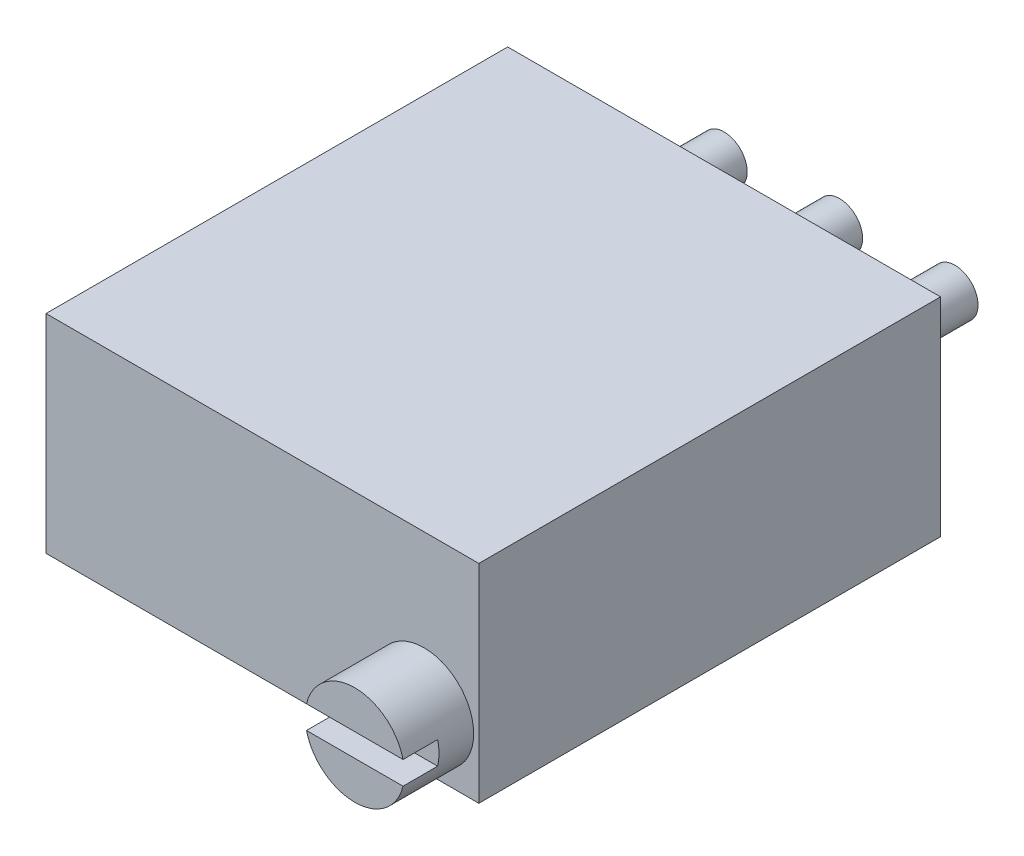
ISO-10303-21;
HEADER;
FILE_DESCRIPTION(('STEP AP214'),'2;1');
FILE_NAME('part.step','',(''),(''),'','','');
FILE_SCHEMA(('AUTOMOTIVE_DESIGN { 1 0 10303 214 1 1 1 1 }'));
ENDSEC;
DATA;
#1=APPLICATION_CONTEXT('core data for automotive mechanical design processes');
#2=APPLICATION_PROTOCOL_DEFINITION('international standard','automotive_design',2000,#1);
#3=PRODUCT_CONTEXT('',#1,'mechanical');
#4=PRODUCT('Part','Part','',(#3));
#5=PRODUCT_RELATED_PRODUCT_CATEGORY('part','',(#4));
#6=PRODUCT_DEFINITION_FORMATION('','',#4);
#7=PRODUCT_DEFINITION_CONTEXT('part definition',#1,'design');
#8=PRODUCT_DEFINITION('design','',#6,#7);
#9=PRODUCT_DEFINITION_SHAPE('','',#8);
#10=(LENGTH_UNIT() NAMED_UNIT(*) SI_UNIT(.MILLI.,.METRE.));
#11=(NAMED_UNIT(*) PLANE_ANGLE_UNIT() SI_UNIT($,.RADIAN.));
#12=(NAMED_UNIT(*) SI_UNIT($,.STERADIAN.) SOLID_ANGLE_UNIT());
#13=UNCERTAINTY_MEASURE_WITH_UNIT(LENGTH_MEASURE(1.E-05),#10,'distance_accuracy_value','');
#14=(GEOMETRIC_REPRESENTATION_CONTEXT(3) GLOBAL_UNCERTAINTY_ASSIGNED_CONTEXT((#13)) GLOBAL_UNIT_ASSIGNED_CONTEXT((#10,
#11,#12)) REPRESENTATION_CONTEXT('',''));
#15=CARTESIAN_POINT('',(0.,0.,0.));
#16=DIRECTION('',(0.,0.,1.));
#17=DIRECTION('',(1.,0.,0.));
#18=AXIS2_PLACEMENT_3D('',#15,#16,#17);
#19=CARTESIAN_POINT('',(3.556,-1.016,11.684));
#20=DIRECTION('',(0.,0.,1.));
#21=DIRECTION('',(1.,0.,0.));
#22=AXIS2_PLACEMENT_3D('',#19,#20,#21);
#23=PLANE('',#22);
#24=DIRECTION('',(-1.,0.,0.));
#25=VECTOR('',#24,1.);
#26=CARTESIAN_POINT('',(3.556,-0.762,11.684));
#27=LINE('',#26,#25);
#28=CARTESIAN_POINT('',(4.61825460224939,-0.762,11.684));
#29=VERTEX_POINT('',#28);
#30=CARTESIAN_POINT('',(2.49374539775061,-0.762,11.684));
#31=VERTEX_POINT('',#30);
#32=EDGE_CURVE('E85',#29,#31,#27,.T.);
#33=ORIENTED_EDGE('',*,*,#32,.F.);
#34=CARTESIAN_POINT('',(3.556,-1.016,11.684));
#35=DIRECTION('',(0.,0.,1.));
#36=DIRECTION('',(1.,0.,0.));
#37=AXIS2_PLACEMENT_3D('',#34,#35,#36);
#38=CIRCLE('',#37,1.0922);
#39=EDGE_CURVE('E86',#29,#31,#38,.T.);
#40=ORIENTED_EDGE('',*,*,#39,.T.);
#41=EDGE_LOOP('',(#33,#40));
#42=FACE_BOUND('',#41,.T.);
#43=ADVANCED_FACE('F40',(#42),#23,.T.);
#44=CARTESIAN_POINT('',(3.556,-1.016,11.684));
#45=DIRECTION('',(0.,0.,-1.));
#46=DIRECTION('',(-1.,0.,0.));
#47=AXIS2_PLACEMENT_3D('',#44,#45,#46);
#48=CYLINDRICAL_SURFACE('',#47,1.0922);
#49=CARTESIAN_POINT('',(3.556,-1.016,10.922));
#50=DIRECTION('',(0.,0.,1.));
#51=DIRECTION('',(1.,0.,0.));
#52=AXIS2_PLACEMENT_3D('',#49,#50,#51);
#53=CIRCLE('',#52,1.0922);
#54=CARTESIAN_POINT('',(2.49374539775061,-0.762,10.922));
#55=VERTEX_POINT('',#54);
#56=CARTESIAN_POINT('',(2.49374539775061,-1.27,10.922));
#57=VERTEX_POINT('',#56);
#58=EDGE_CURVE('E12',#55,#57,#53,.T.);
#59=ORIENTED_EDGE('',*,*,#58,.F.);
#60=DIRECTION('',(0.,0.,-1.));
#61=VECTOR('',#60,1.);
#62=CARTESIAN_POINT('',(2.49374539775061,-0.762,11.684));
#63=LINE('',#62,#61);
#64=EDGE_CURVE('E111',#55,#31,#63,.F.);
#65=ORIENTED_EDGE('',*,*,#64,.T.);
#66=ORIENTED_EDGE('',*,*,#39,.F.);
#67=DIRECTION('',(0.,0.,-1.));
#68=VECTOR('',#67,1.);
#69=CARTESIAN_POINT('',(4.61825460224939,-0.762,11.684));
#70=LINE('',#69,#68);
#71=CARTESIAN_POINT('',(4.61825460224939,-0.762,10.922));
#72=VERTEX_POINT('',#71);
#73=EDGE_CURVE('E99',#29,#72,#70,.T.);
#74=ORIENTED_EDGE('',*,*,#73,.T.);
#75=CARTESIAN_POINT('',(4.61825460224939,-1.27,10.922));
#76=VERTEX_POINT('',#75);
#77=EDGE_CURVE('E44',#76,#72,#53,.T.);
#78=ORIENTED_EDGE('',*,*,#77,.F.);
#79=DIRECTION('',(0.,0.,-1.));
#80=VECTOR('',#79,1.);
#81=CARTESIAN_POINT('',(4.61825460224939,-1.27,11.684));
#82=LINE('',#81,#80);
#83=CARTESIAN_POINT('',(4.61825460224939,-1.27,11.684));
#84=VERTEX_POINT('',#83);
#85=EDGE_CURVE('E80',#76,#84,#82,.F.);
#86=ORIENTED_EDGE('',*,*,#85,.T.);
#87=CARTESIAN_POINT('',(2.49374539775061,-1.27,11.684));
#88=VERTEX_POINT('',#87);
#89=EDGE_CURVE('E90',#88,#84,#38,.T.);
#90=ORIENTED_EDGE('',*,*,#89,.F.);
#91=DIRECTION('',(0.,0.,-1.));
#92=VECTOR('',#91,1.);
#93=CARTESIAN_POINT('',(2.49374539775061,-1.27,11.684));
#94=LINE('',#93,#92);
#95=EDGE_CURVE('E55',#88,#57,#94,.T.);
#96=ORIENTED_EDGE('',*,*,#95,.T.);
#97=EDGE_LOOP('',(#59,#65,#66,#74,#78,#86,#90,#96));
#98=FACE_BOUND('',#97,.T.);
#99=CARTESIAN_POINT('',(3.556,-1.016,10.16));
#100=DIRECTION('',(0.,0.,1.));
#101=DIRECTION('',(1.,0.,0.));
#102=AXIS2_PLACEMENT_3D('',#99,#100,#101);
#103=CIRCLE('',#102,1.0922);
#104=CARTESIAN_POINT('',(4.6482,-1.016,10.16));
#105=VERTEX_POINT('',#104);
#106=EDGE_CURVE('E95',#105,#105,#103,.T.);
#107=ORIENTED_EDGE('',*,*,#106,.T.);
#108=EDGE_LOOP('',(#107));
#109=FACE_BOUND('',#108,.T.);
#110=ADVANCED_FACE('F42',(#98,#109),#48,.T.);
#111=DIRECTION('',(1.,0.,0.));
#112=VECTOR('',#111,1.);
#113=CARTESIAN_POINT('',(3.556,-1.27,11.684));
#114=LINE('',#113,#112);
#115=EDGE_CURVE('E77',#88,#84,#114,.T.);
#116=ORIENTED_EDGE('',*,*,#115,.F.);
#117=ORIENTED_EDGE('',*,*,#89,.T.);
#118=EDGE_LOOP('',(#116,#117));
#119=FACE_BOUND('',#118,.T.);
#120=ADVANCED_FACE('F94',(#119),#23,.T.);
#121=CARTESIAN_POINT('',(3.556,-1.016,10.16));
#122=DIRECTION('',(0.,0.,1.));
#123=DIRECTION('',(1.,0.,0.));
#124=AXIS2_PLACEMENT_3D('',#121,#122,#123);
#125=PLANE('',#124);
#126=ORIENTED_EDGE('',*,*,#106,.F.);
#127=EDGE_LOOP('',(#126));
#128=FACE_BOUND('',#127,.T.);
#129=ADVANCED_FACE('F124',(#128),#125,.F.);
#130=CARTESIAN_POINT('',(2.4638,-1.27,10.922));
#131=DIRECTION('',(0.,0.,1.));
#132=DIRECTION('',(1.,0.,0.));
#133=AXIS2_PLACEMENT_3D('',#130,#131,#132);
#134=PLANE('',#133);
#135=DIRECTION('',(-1.,0.,0.));
#136=VECTOR('',#135,1.);
#137=CARTESIAN_POINT('',(2.4638,-0.762,10.922));
#138=LINE('',#137,#136);
#139=EDGE_CURVE('E92',#72,#55,#138,.T.);
#140=ORIENTED_EDGE('',*,*,#139,.T.);
#141=ORIENTED_EDGE('',*,*,#58,.T.);
#142=DIRECTION('',(1.,0.,0.));
#143=VECTOR('',#142,1.);
#144=CARTESIAN_POINT('',(2.4638,-1.27,10.922));
#145=LINE('',#144,#143);
#146=EDGE_CURVE('E109',#57,#76,#145,.T.);
#147=ORIENTED_EDGE('',*,*,#146,.T.);
#148=ORIENTED_EDGE('',*,*,#77,.T.);
#149=EDGE_LOOP('',(#140,#141,#147,#148));
#150=FACE_BOUND('',#149,.T.);
#151=ADVANCED_FACE('F108',(#150),#134,.T.);
#152=CARTESIAN_POINT('',(2.4638,-0.762,10.922));
#153=DIRECTION('',(0.,1.,0.));
#154=DIRECTION('',(0.,0.,1.));
#155=AXIS2_PLACEMENT_3D('',#152,#153,#154);
#156=PLANE('',#155);
#157=ORIENTED_EDGE('',*,*,#32,.T.);
#158=ORIENTED_EDGE('',*,*,#64,.F.);
#159=ORIENTED_EDGE('',*,*,#139,.F.);
#160=ORIENTED_EDGE('',*,*,#73,.F.);
#161=EDGE_LOOP('',(#157,#158,#159,#160));
#162=FACE_BOUND('',#161,.T.);
#163=ADVANCED_FACE('F110',(#162),#156,.F.);
#164=CARTESIAN_POINT('',(2.4638,-1.27,10.922));
#165=DIRECTION('',(0.,-1.,0.));
#166=DIRECTION('',(0.,0.,-1.));
#167=AXIS2_PLACEMENT_3D('',#164,#165,#166);
#168=PLANE('',#167);
#169=ORIENTED_EDGE('',*,*,#115,.T.);
#170=ORIENTED_EDGE('',*,*,#85,.F.);
#171=ORIENTED_EDGE('',*,*,#146,.F.);
#172=ORIENTED_EDGE('',*,*,#95,.F.);
#173=EDGE_LOOP('',(#169,#170,#171,#172));
#174=FACE_BOUND('',#173,.T.);
#175=ADVANCED_FACE('F79',(#174),#168,.F.);
#176=CLOSED_SHELL('',(#43,#110,#120,#129,#151,#163,#175));
#177=MANIFOLD_SOLID_BREP('B2',#176);
#178=CARTESIAN_POINT('',(0.,0.,-2.54));
#179=DIRECTION('',(0.,0.,1.));
#180=DIRECTION('',(1.,0.,0.));
#181=AXIS2_PLACEMENT_3D('',#178,#179,#180);
#182=CYLINDRICAL_SURFACE('',#181,0.508);
#183=CARTESIAN_POINT('',(0.,0.,-2.54));
#184=DIRECTION('',(0.,0.,-1.));
#185=DIRECTION('',(-1.,0.,0.));
#186=AXIS2_PLACEMENT_3D('',#183,#184,#185);
#187=CIRCLE('',#186,0.508);
#188=CARTESIAN_POINT('',(-0.508,0.,-2.54));
#189=VERTEX_POINT('',#188);
#190=EDGE_CURVE('E39',#189,#189,#187,.T.);
#191=ORIENTED_EDGE('',*,*,#190,.F.);
#192=EDGE_LOOP('',(#191));
#193=FACE_BOUND('',#192,.T.);
#194=CARTESIAN_POINT('',(0.,0.,0.));
#195=DIRECTION('',(0.,0.,-1.));
#196=DIRECTION('',(-1.,0.,0.));
#197=AXIS2_PLACEMENT_3D('',#194,#195,#196);
#198=CIRCLE('',#197,0.508);
#199=CARTESIAN_POINT('',(-0.508,0.,0.));
#200=VERTEX_POINT('',#199);
#201=EDGE_CURVE('E187',#200,#200,#198,.T.);
#202=ORIENTED_EDGE('',*,*,#201,.T.);
#203=EDGE_LOOP('',(#202));
#204=FACE_BOUND('',#203,.T.);
#205=ADVANCED_FACE('F184',(#193,#204),#182,.T.);
#206=CARTESIAN_POINT('',(0.,0.,-2.54));
#207=DIRECTION('',(0.,0.,-1.));
#208=DIRECTION('',(-1.,0.,0.));
#209=AXIS2_PLACEMENT_3D('',#206,#207,#208);
#210=PLANE('',#209);
#211=ORIENTED_EDGE('',*,*,#190,.T.);
#212=EDGE_LOOP('',(#211));
#213=FACE_BOUND('',#212,.T.);
#214=ADVANCED_FACE('F199',(#213),#210,.T.);
#215=CARTESIAN_POINT('',(0.,0.,0.));
#216=DIRECTION('',(0.,0.,-1.));
#217=DIRECTION('',(-1.,0.,0.));
#218=AXIS2_PLACEMENT_3D('',#215,#216,#217);
#219=PLANE('',#218);
#220=ORIENTED_EDGE('',*,*,#201,.F.);
#221=EDGE_LOOP('',(#220));
#222=FACE_BOUND('',#221,.T.);
#223=ADVANCED_FACE('F197',(#222),#219,.F.);
#224=CLOSED_SHELL('',(#205,#214,#223));
#225=MANIFOLD_SOLID_BREP('B6',#224);
#226=CARTESIAN_POINT('',(2.54,0.,-2.54));
#227=DIRECTION('',(0.,0.,1.));
#228=DIRECTION('',(1.,0.,0.));
#229=AXIS2_PLACEMENT_3D('',#226,#227,#228);
#230=CYLINDRICAL_SURFACE('',#229,0.508);
#231=CARTESIAN_POINT('',(2.54,0.,-2.54));
#232=DIRECTION('',(0.,0.,-1.));
#233=DIRECTION('',(-1.,0.,0.));
#234=AXIS2_PLACEMENT_3D('',#231,#232,#233);
#235=CIRCLE('',#234,0.508);
#236=CARTESIAN_POINT('',(2.032,0.,-2.54));
#237=VERTEX_POINT('',#236);
#238=EDGE_CURVE('E183',#237,#237,#235,.T.);
#239=ORIENTED_EDGE('',*,*,#238,.F.);
#240=EDGE_LOOP('',(#239));
#241=FACE_BOUND('',#240,.T.);
#242=CARTESIAN_POINT('',(2.54,0.,0.));
#243=DIRECTION('',(0.,0.,-1.));
#244=DIRECTION('',(-1.,0.,0.));
#245=AXIS2_PLACEMENT_3D('',#242,#243,#244);
#246=CIRCLE('',#245,0.508);
#247=CARTESIAN_POINT('',(2.032,0.,0.));
#248=VERTEX_POINT('',#247);
#249=EDGE_CURVE('E236',#248,#248,#246,.T.);
#250=ORIENTED_EDGE('',*,*,#249,.T.);
#251=EDGE_LOOP('',(#250));
#252=FACE_BOUND('',#251,.T.);
#253=ADVANCED_FACE('F233',(#241,#252),#230,.T.);
#254=CARTESIAN_POINT('',(2.54,0.,-2.54));
#255=DIRECTION('',(0.,0.,-1.));
#256=DIRECTION('',(-1.,0.,0.));
#257=AXIS2_PLACEMENT_3D('',#254,#255,#256);
#258=PLANE('',#257);
#259=ORIENTED_EDGE('',*,*,#238,.T.);
#260=EDGE_LOOP('',(#259));
#261=FACE_BOUND('',#260,.T.);
#262=ADVANCED_FACE('F248',(#261),#258,.T.);
#263=CARTESIAN_POINT('',(2.54,0.,0.));
#264=DIRECTION('',(0.,0.,-1.));
#265=DIRECTION('',(-1.,0.,0.));
#266=AXIS2_PLACEMENT_3D('',#263,#264,#265);
#267=PLANE('',#266);
#268=ORIENTED_EDGE('',*,*,#249,.F.);
#269=EDGE_LOOP('',(#268));
#270=FACE_BOUND('',#269,.T.);
#271=ADVANCED_FACE('F246',(#270),#267,.F.);
#272=CLOSED_SHELL('',(#253,#262,#271));
#273=MANIFOLD_SOLID_BREP('B34',#272);
#274=CARTESIAN_POINT('',(-2.54,0.,-2.54));
#275=DIRECTION('',(0.,0.,1.));
#276=DIRECTION('',(1.,0.,0.));
#277=AXIS2_PLACEMENT_3D('',#274,#275,#276);
#278=CYLINDRICAL_SURFACE('',#277,0.508);
#279=CARTESIAN_POINT('',(-2.54,0.,-2.54));
#280=DIRECTION('',(0.,0.,-1.));
#281=DIRECTION('',(-1.,0.,0.));
#282=AXIS2_PLACEMENT_3D('',#279,#280,#281);
#283=CIRCLE('',#282,0.508);
#284=CARTESIAN_POINT('',(-3.048,0.,-2.54));
#285=VERTEX_POINT('',#284);
#286=EDGE_CURVE('E232',#285,#285,#283,.T.);
#287=ORIENTED_EDGE('',*,*,#286,.F.);
#288=EDGE_LOOP('',(#287));
#289=FACE_BOUND('',#288,.T.);
#290=CARTESIAN_POINT('',(-2.54,0.,0.));
#291=DIRECTION('',(0.,0.,-1.));
#292=DIRECTION('',(-1.,0.,0.));
#293=AXIS2_PLACEMENT_3D('',#290,#291,#292);
#294=CIRCLE('',#293,0.508);
#295=CARTESIAN_POINT('',(-3.048,0.,0.));
#296=VERTEX_POINT('',#295);
#297=EDGE_CURVE('E286',#296,#296,#294,.T.);
#298=ORIENTED_EDGE('',*,*,#297,.T.);
#299=EDGE_LOOP('',(#298));
#300=FACE_BOUND('',#299,.T.);
#301=ADVANCED_FACE('F283',(#289,#300),#278,.T.);
#302=CARTESIAN_POINT('',(-2.54,0.,-2.54));
#303=DIRECTION('',(0.,0.,-1.));
#304=DIRECTION('',(-1.,0.,0.));
#305=AXIS2_PLACEMENT_3D('',#302,#303,#304);
#306=PLANE('',#305);
#307=ORIENTED_EDGE('',*,*,#286,.T.);
#308=EDGE_LOOP('',(#307));
#309=FACE_BOUND('',#308,.T.);
#310=ADVANCED_FACE('F298',(#309),#306,.T.);
#311=CARTESIAN_POINT('',(-2.54,0.,0.));
#312=DIRECTION('',(0.,0.,-1.));
#313=DIRECTION('',(-1.,0.,0.));
#314=AXIS2_PLACEMENT_3D('',#311,#312,#313);
#315=PLANE('',#314);
#316=ORIENTED_EDGE('',*,*,#297,.F.);
#317=EDGE_LOOP('',(#316));
#318=FACE_BOUND('',#317,.T.);
#319=ADVANCED_FACE('F296',(#318),#315,.F.);
#320=CLOSED_SHELL('',(#301,#310,#319));
#321=MANIFOLD_SOLID_BREP('B178',#320);
#322=CARTESIAN_POINT('',(-4.7625,2.286,10.16));
#323=DIRECTION('',(1.,0.,0.));
#324=DIRECTION('',(0.,0.,-1.));
#325=AXIS2_PLACEMENT_3D('',#322,#323,#324);
#326=PLANE('',#325);
#327=DIRECTION('',(0.,-1.,0.));
#328=VECTOR('',#327,1.);
#329=CARTESIAN_POINT('',(-4.7625,2.286,0.));
#330=LINE('',#329,#328);
#331=CARTESIAN_POINT('',(-4.7625,2.286,0.));
#332=VERTEX_POINT('',#331);
#333=CARTESIAN_POINT('',(-4.7625,-2.286,0.));
#334=VERTEX_POINT('',#333);
#335=EDGE_CURVE('E387',#332,#334,#330,.T.);
#336=ORIENTED_EDGE('',*,*,#335,.T.);
#337=DIRECTION('',(0.,0.,-1.));
#338=VECTOR('',#337,1.);
#339=CARTESIAN_POINT('',(-4.7625,-2.286,10.16));
#340=LINE('',#339,#338);
#341=CARTESIAN_POINT('',(-4.7625,-2.286,10.16));
#342=VERTEX_POINT('',#341);
#343=EDGE_CURVE('E281',#342,#334,#340,.T.);
#344=ORIENTED_EDGE('',*,*,#343,.F.);
#345=DIRECTION('',(0.,-1.,0.));
#346=VECTOR('',#345,1.);
#347=CARTESIAN_POINT('',(-4.7625,2.286,10.16));
#348=LINE('',#347,#346);
#349=CARTESIAN_POINT('',(-4.7625,2.286,10.16));
#350=VERTEX_POINT('',#349);
#351=EDGE_CURVE('E375',#350,#342,#348,.T.);
#352=ORIENTED_EDGE('',*,*,#351,.F.);
#353=DIRECTION('',(0.,0.,-1.));
#354=VECTOR('',#353,1.);
#355=CARTESIAN_POINT('',(-4.7625,2.286,10.16));
#356=LINE('',#355,#354);
#357=EDGE_CURVE('E383',#350,#332,#356,.T.);
#358=ORIENTED_EDGE('',*,*,#357,.T.);
#359=EDGE_LOOP('',(#336,#344,#352,#358));
#360=FACE_BOUND('',#359,.T.);
#361=ADVANCED_FACE('F324',(#360),#326,.F.);
#362=CARTESIAN_POINT('',(-4.7625,-2.286,10.16));
#363=DIRECTION('',(0.,1.,0.));
#364=DIRECTION('',(0.,0.,1.));
#365=AXIS2_PLACEMENT_3D('',#362,#363,#364);
#366=PLANE('',#365);
#367=DIRECTION('',(1.,0.,0.));
#368=VECTOR('',#367,1.);
#369=CARTESIAN_POINT('',(-4.7625,-2.286,0.));
#370=LINE('',#369,#368);
#371=CARTESIAN_POINT('',(4.7625,-2.286,0.));
#372=VERTEX_POINT('',#371);
#373=EDGE_CURVE('E379',#334,#372,#370,.T.);
#374=ORIENTED_EDGE('',*,*,#373,.T.);
#375=DIRECTION('',(0.,0.,-1.));
#376=VECTOR('',#375,1.);
#377=CARTESIAN_POINT('',(4.7625,-2.286,10.16));
#378=LINE('',#377,#376);
#379=CARTESIAN_POINT('',(4.7625,-2.286,10.16));
#380=VERTEX_POINT('',#379);
#381=EDGE_CURVE('E332',#380,#372,#378,.T.);
#382=ORIENTED_EDGE('',*,*,#381,.F.);
#383=DIRECTION('',(1.,0.,0.));
#384=VECTOR('',#383,1.);
#385=CARTESIAN_POINT('',(-4.7625,-2.286,10.16));
#386=LINE('',#385,#384);
#387=EDGE_CURVE('E370',#342,#380,#386,.T.);
#388=ORIENTED_EDGE('',*,*,#387,.F.);
#389=ORIENTED_EDGE('',*,*,#343,.T.);
#390=EDGE_LOOP('',(#374,#382,#388,#389));
#391=FACE_BOUND('',#390,.T.);
#392=ADVANCED_FACE('F378',(#391),#366,.F.);
#393=CARTESIAN_POINT('',(4.7625,2.286,10.16));
#394=DIRECTION('',(-1.,0.,0.));
#395=DIRECTION('',(0.,0.,1.));
#396=AXIS2_PLACEMENT_3D('',#393,#394,#395);
#397=PLANE('',#396);
#398=DIRECTION('',(0.,1.,0.));
#399=VECTOR('',#398,1.);
#400=CARTESIAN_POINT('',(4.7625,2.286,0.));
#401=LINE('',#400,#399);
#402=CARTESIAN_POINT('',(4.7625,2.286,0.));
#403=VERTEX_POINT('',#402);
#404=EDGE_CURVE('E357',#372,#403,#401,.T.);
#405=ORIENTED_EDGE('',*,*,#404,.T.);
#406=DIRECTION('',(0.,0.,-1.));
#407=VECTOR('',#406,1.);
#408=CARTESIAN_POINT('',(4.7625,2.286,10.16));
#409=LINE('',#408,#407);
#410=CARTESIAN_POINT('',(4.7625,2.286,10.16));
#411=VERTEX_POINT('',#410);
#412=EDGE_CURVE('E380',#411,#403,#409,.T.);
#413=ORIENTED_EDGE('',*,*,#412,.F.);
#414=DIRECTION('',(0.,1.,0.));
#415=VECTOR('',#414,1.);
#416=CARTESIAN_POINT('',(4.7625,2.286,10.16));
#417=LINE('',#416,#415);
#418=EDGE_CURVE('E373',#380,#411,#417,.T.);
#419=ORIENTED_EDGE('',*,*,#418,.F.);
#420=ORIENTED_EDGE('',*,*,#381,.T.);
#421=EDGE_LOOP('',(#405,#413,#419,#420));
#422=FACE_BOUND('',#421,.T.);
#423=ADVANCED_FACE('F381',(#422),#397,.F.);
#424=CARTESIAN_POINT('',(-4.7625,2.286,10.16));
#425=DIRECTION('',(0.,-1.,0.));
#426=DIRECTION('',(0.,0.,-1.));
#427=AXIS2_PLACEMENT_3D('',#424,#425,#426);
#428=PLANE('',#427);
#429=DIRECTION('',(-1.,0.,0.));
#430=VECTOR('',#429,1.);
#431=CARTESIAN_POINT('',(-4.7625,2.286,0.));
#432=LINE('',#431,#430);
#433=EDGE_CURVE('E363',#403,#332,#432,.T.);
#434=ORIENTED_EDGE('',*,*,#433,.T.);
#435=ORIENTED_EDGE('',*,*,#357,.F.);
#436=DIRECTION('',(-1.,0.,0.));
#437=VECTOR('',#436,1.);
#438=CARTESIAN_POINT('',(-4.7625,2.286,10.16));
#439=LINE('',#438,#437);
#440=EDGE_CURVE('E340',#411,#350,#439,.T.);
#441=ORIENTED_EDGE('',*,*,#440,.F.);
#442=ORIENTED_EDGE('',*,*,#412,.T.);
#443=EDGE_LOOP('',(#434,#435,#441,#442));
#444=FACE_BOUND('',#443,.T.);
#445=ADVANCED_FACE('F394',(#444),#428,.F.);
#446=CARTESIAN_POINT('',(-4.7625,-2.286,10.16));
#447=DIRECTION('',(0.,0.,1.));
#448=DIRECTION('',(1.,0.,0.));
#449=AXIS2_PLACEMENT_3D('',#446,#447,#448);
#450=PLANE('',#449);
#451=ORIENTED_EDGE('',*,*,#351,.T.);
#452=ORIENTED_EDGE('',*,*,#387,.T.);
#453=ORIENTED_EDGE('',*,*,#418,.T.);
#454=ORIENTED_EDGE('',*,*,#440,.T.);
#455=EDGE_LOOP('',(#451,#452,#453,#454));
#456=FACE_BOUND('',#455,.T.);
#457=ADVANCED_FACE('F371',(#456),#450,.T.);
#458=CARTESIAN_POINT('',(-4.7625,-2.286,0.));
#459=DIRECTION('',(0.,0.,1.));
#460=DIRECTION('',(1.,0.,0.));
#461=AXIS2_PLACEMENT_3D('',#458,#459,#460);
#462=PLANE('',#461);
#463=ORIENTED_EDGE('',*,*,#335,.F.);
#464=ORIENTED_EDGE('',*,*,#433,.F.);
#465=ORIENTED_EDGE('',*,*,#404,.F.);
#466=ORIENTED_EDGE('',*,*,#373,.F.);
#467=EDGE_LOOP('',(#463,#464,#465,#466));
#468=FACE_BOUND('',#467,.T.);
#469=ADVANCED_FACE('F397',(#468),#462,.F.);
#470=CLOSED_SHELL('',(#361,#392,#423,#445,#457,#469));
#471=MANIFOLD_SOLID_BREP('B227',#470);
#472=ADVANCED_BREP_SHAPE_REPRESENTATION('',(#18,#177,#225,#273,#321,#471),#14);
#473=SHAPE_DEFINITION_REPRESENTATION(#9,#472);
ENDSEC;
END-ISO-10303-21;
